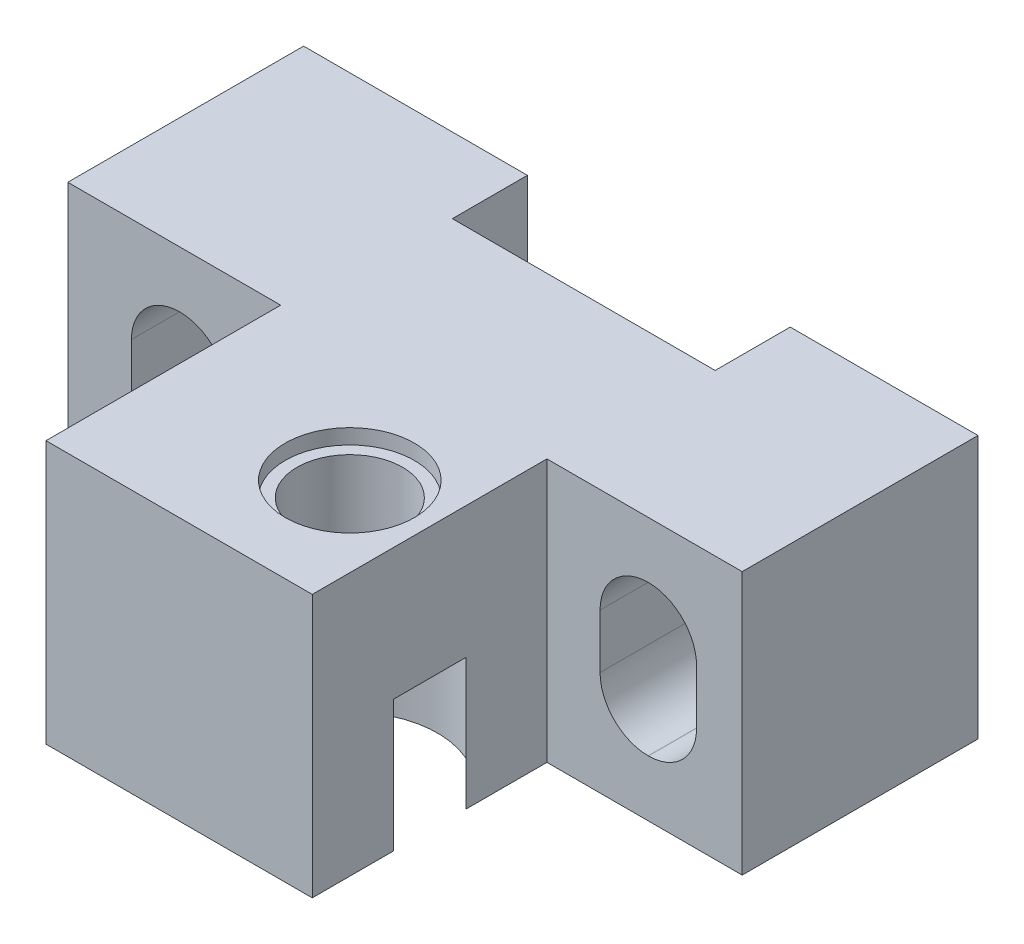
from build123d import *

# Parameters (mm, degrees)
SKETCH1_W          = 22.8092
SKETCH1_H          = 8.89
EXTRUDE1_DEPTH     = 7.9756
SKETCH2_W          = 8.89
SKETCH2_H          = 8.89
CUT_EXTRUDE1_DEPTH = 2.54
SKETCH7_W          = 9.0052
SKETCH7_H          = 8.89
NEW_2_DEPTH        = 7.9375
SKETCH5_W          = 3.2639
SKETCH5_H          = 5.08
CUT_EXTRUDE2_DEPTH = 19.024843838
FILLET1_R          = 1.6256
SKETCH6_W          = 3.2639
SKETCH6_H          = 5.08
CUT_EXTRUDE3_DEPTH = 19.024843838
FILLET2_R          = 1.6256
SKETCH8_R          = 1.78435
CUT_EXTRUDE4_DEPTH = 23.682847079
SKETCH9_R          = 2.9718
CUT_EXTRUDE5_DEPTH = 4.445
SKETCH10_R         = 2.1844
CUT_EXTRUDE6_DEPTH = 0.508


with BuildPart() as part:
    # Sketch1 → Extrude1 (new body)
    with BuildSketch(Plane.XY):
        with Locations((-2.0955, -4.445)):
            Rectangle(SKETCH1_W, SKETCH1_H)
    extrude(amount=EXTRUDE1_DEPTH)

    # Sketch2 → Cut-Extrude1 (cut)
    with BuildSketch(Plane(origin=(0, 0, 0), x_dir=(-1, 0, 0), z_dir=(0, 0, -1))):
        with Locations((1.4859, -4.445)):
            Rectangle(SKETCH2_W, SKETCH2_H)
    extrude(amount=-CUT_EXTRUDE1_DEPTH, mode=Mode.SUBTRACT)

    # Sketch7 → New 2 (add)
    with BuildSketch(Plane.XY.offset(7.9756)):
        with Locations((-1.7975, -4.445)):
            Rectangle(SKETCH7_W, SKETCH7_H)
    extrude(amount=NEW_2_DEPTH)

    # Sketch5 → Cut-Extrude2 (cut, through all)
    with BuildSketch(Plane.XY.offset(7.9756)):
        with Locations((6.1341, -4.445)):
            Rectangle(SKETCH5_W, SKETCH5_H)
    extrude(amount=-CUT_EXTRUDE2_DEPTH, mode=Mode.SUBTRACT)

    # Fillet1
    fillet1_edges = [part.edges().sort_by_distance(p)[0] for p in [
        (4.50215, -6.985, 3.9878),
        (4.50215, -1.905, 3.9878),
        (7.76605, -1.905, 3.9878),
        (7.76605, -6.985, 3.9878),
    ]]
    fillet(fillet1_edges, radius=FILLET1_R)

    # Sketch6 → Cut-Extrude3 (cut, through all)
    with BuildSketch(Plane.XY.offset(7.9756)):
        with Locations((-9.7155, -4.445)):
            Rectangle(SKETCH6_W, SKETCH6_H)
    extrude(amount=-CUT_EXTRUDE3_DEPTH, mode=Mode.SUBTRACT)

    # Fillet2
    fillet2_edges = [part.edges().sort_by_distance(p)[0] for p in [
        (-11.34745, -6.985, 3.9878),
        (-11.34745, -1.905, 3.9878),
        (-8.08355, -1.905, 3.9878),
        (-8.08355, -6.985, 3.9878),
    ]]
    fillet(fillet2_edges, radius=FILLET2_R)

    # Sketch8 → Cut-Extrude4 (cut, through all)
    with BuildSketch(Plane(origin=(0, 0, 0), x_dir=(-1, 0, 0), z_dir=(0, 1, 0))):
        with Locations(Location((0, 11.938, 0), (0, 0, 90))):
            Circle(SKETCH8_R)
    extrude(amount=-CUT_EXTRUDE4_DEPTH, mode=Mode.SUBTRACT)

    # Sketch9 → Cut-Extrude5 (cut)
    with BuildSketch(Plane.XZ.offset(8.89)):
        with Locations((0, 11.938)):
            Circle(SKETCH9_R)
    extrude(amount=-CUT_EXTRUDE5_DEPTH, mode=Mode.SUBTRACT)

    # Sketch10 → Cut-Extrude6 (cut)
    with BuildSketch(Plane(origin=(0, 0, 0), x_dir=(1, 0, 0), z_dir=(0, 1, 0))):
        with Locations(Location((0, -11.938, 0), (0, 0, 270))):
            Circle(SKETCH10_R)
    extrude(amount=-CUT_EXTRUDE6_DEPTH, mode=Mode.SUBTRACT)


solid = part.part
